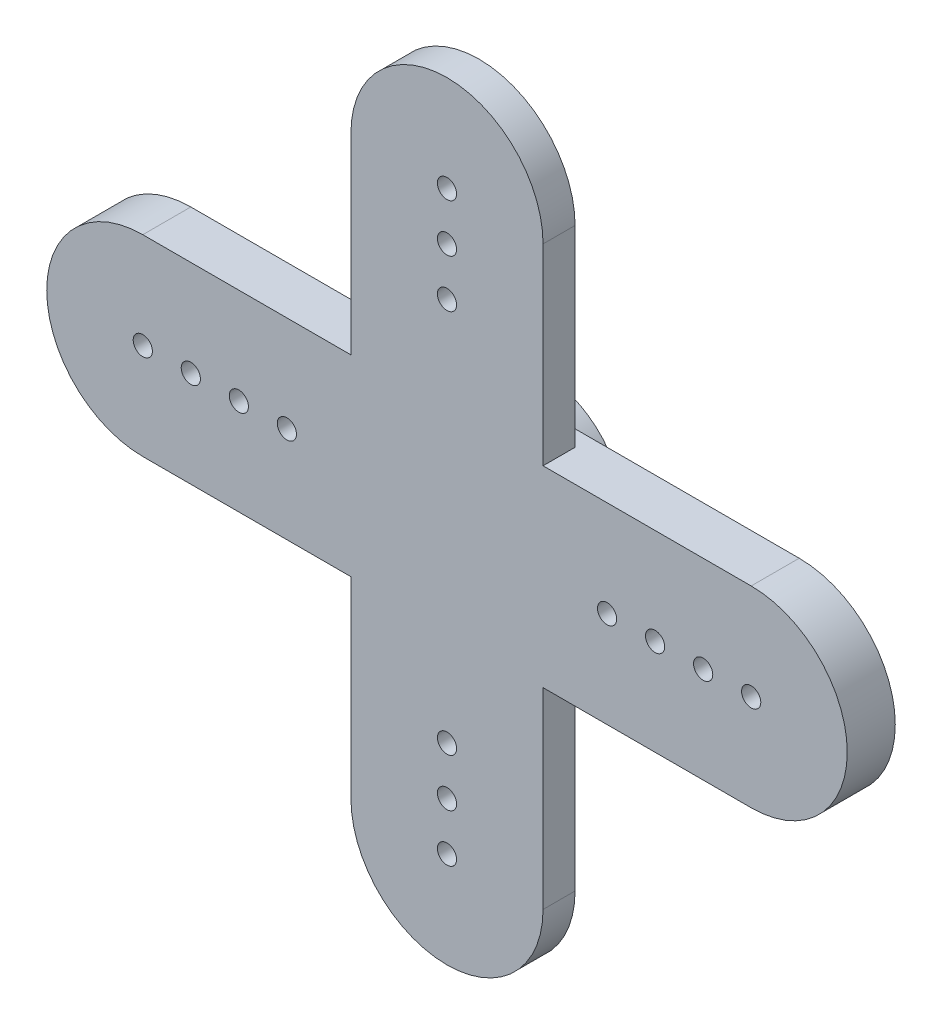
from build123d import *

# Parameters (mm, degrees)
ESQUISSE1_R      = 0.6
EXTRUSION5_DEPTH = 3
ESQUISSE5_R      = 0.6
EXTRUSION6_DEPTH = 2
ESQUISSE6_R      = 5
EXTRUSION7_DEPTH = 3
ESQUISSE7_R      = 2.9
EXTRUSION8_DEPTH = 2.7


with BuildPart() as part:
    # Esquisse1 → Extrusion5 (new body)
    with BuildSketch(Plane.XY):
        with BuildLine():
            Line((-19, 6), (19, 6))
            ThreePointArc((19, 6), (25, 0), (19, -6))
            Line((19, -6), (-19, -6))
            ThreePointArc((-19, -6), (-25, 0), (-19, 6))
        make_face()
        with Locations((-19, 0)):
            Circle(ESQUISSE1_R, mode=Mode.SUBTRACT)
        with Locations((-16, 0)):
            Circle(ESQUISSE1_R, mode=Mode.SUBTRACT)
        with Locations((-13, 0)):
            Circle(ESQUISSE1_R, mode=Mode.SUBTRACT)
        with Locations((13, 0)):
            Circle(ESQUISSE1_R, mode=Mode.SUBTRACT)
        with Locations((16, 0)):
            Circle(ESQUISSE1_R, mode=Mode.SUBTRACT)
        with Locations((19, 0)):
            Circle(ESQUISSE1_R, mode=Mode.SUBTRACT)
        with Locations((10, 0)):
            Circle(ESQUISSE1_R, mode=Mode.SUBTRACT)
        with Locations((-10, 0)):
            Circle(ESQUISSE1_R, mode=Mode.SUBTRACT)
    extrude(amount=EXTRUSION5_DEPTH)

    # Esquisse5 → Extrusion6 (add)
    with BuildSketch(Plane.XY.offset(3)):
        with BuildLine():
            Line((-6, 18), (-6, -18))
            ThreePointArc((-6, -18), (0, -24), (6, -18))
            Line((6, -18), (6, 18))
            ThreePointArc((6, 18), (0, 24), (-6, 18))
        make_face()
        with Locations((0, 18)):
            Circle(ESQUISSE5_R, mode=Mode.SUBTRACT)
        with Locations((0, 15)):
            Circle(ESQUISSE5_R, mode=Mode.SUBTRACT)
        with Locations((0, 12)):
            Circle(ESQUISSE5_R, mode=Mode.SUBTRACT)
        with Locations((0, -12)):
            Circle(ESQUISSE5_R, mode=Mode.SUBTRACT)
        with Locations((0, -15)):
            Circle(ESQUISSE5_R, mode=Mode.SUBTRACT)
        with Locations((0, -18)):
            Circle(ESQUISSE5_R, mode=Mode.SUBTRACT)
    extrude(amount=-EXTRUSION6_DEPTH)

    # Esquisse6 → Extrusion7 (add)
    with BuildSketch(Plane(origin=(0, 0, 0), x_dir=(-1, 0, 0), z_dir=(0, 0, -1))):
        with Locations(Location((0, 0, 0), (0, 0, 180))):
            Circle(ESQUISSE6_R)
    extrude(amount=EXTRUSION7_DEPTH)

    # Esquisse7 → Extrusion8 (cut)
    with BuildSketch(Plane(origin=(0, 0, -3), x_dir=(-1, 0, 0), z_dir=(0, 0, -1))):
        Circle(ESQUISSE7_R)
    extrude(amount=-EXTRUSION8_DEPTH, mode=Mode.SUBTRACT)


solid = part.part
